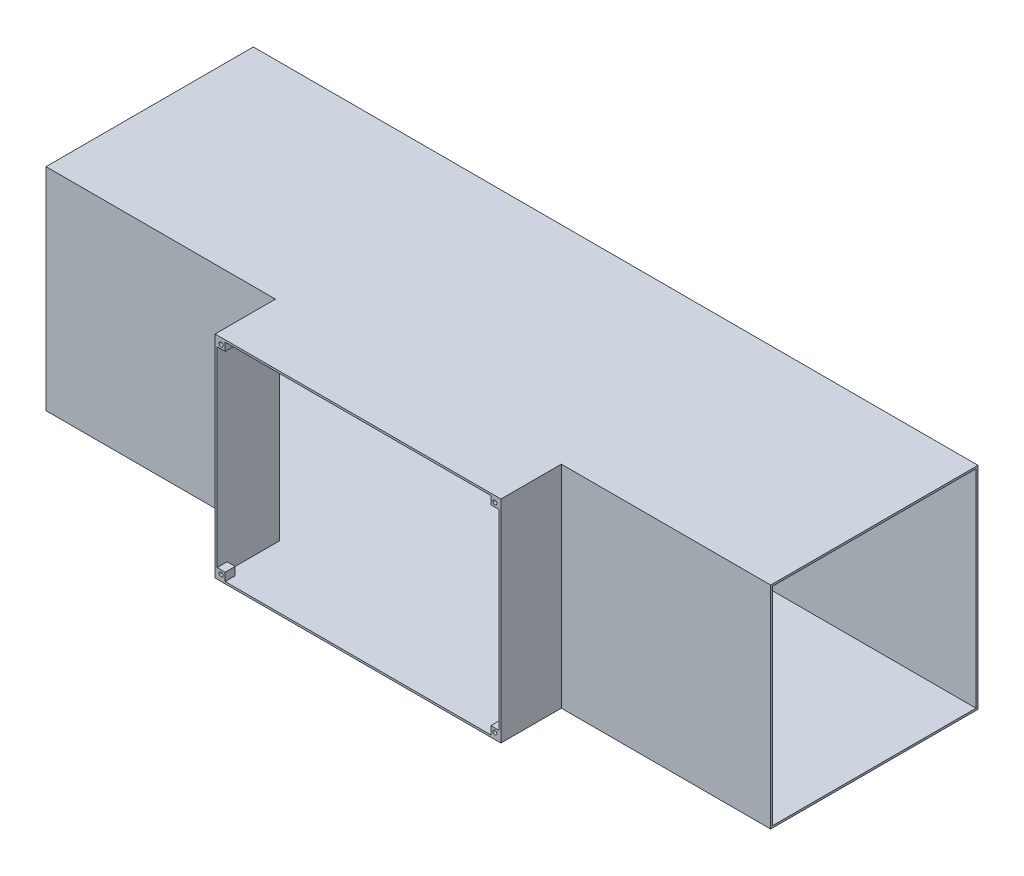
ISO-10303-21;
HEADER;
FILE_DESCRIPTION(('STEP AP214'),'2;1');
FILE_NAME('part.step','',(''),(''),'','','');
FILE_SCHEMA(('AUTOMOTIVE_DESIGN { 1 0 10303 214 1 1 1 1 }'));
ENDSEC;
DATA;
#1=APPLICATION_CONTEXT('core data for automotive mechanical design processes');
#2=APPLICATION_PROTOCOL_DEFINITION('international standard','automotive_design',2000,#1);
#3=PRODUCT_CONTEXT('',#1,'mechanical');
#4=PRODUCT('Part','Part','',(#3));
#5=PRODUCT_RELATED_PRODUCT_CATEGORY('part','',(#4));
#6=PRODUCT_DEFINITION_FORMATION('','',#4);
#7=PRODUCT_DEFINITION_CONTEXT('part definition',#1,'design');
#8=PRODUCT_DEFINITION('design','',#6,#7);
#9=PRODUCT_DEFINITION_SHAPE('','',#8);
#10=(LENGTH_UNIT() NAMED_UNIT(*) SI_UNIT(.MILLI.,.METRE.));
#11=(NAMED_UNIT(*) PLANE_ANGLE_UNIT() SI_UNIT($,.RADIAN.));
#12=(NAMED_UNIT(*) SI_UNIT($,.STERADIAN.) SOLID_ANGLE_UNIT());
#13=UNCERTAINTY_MEASURE_WITH_UNIT(LENGTH_MEASURE(1.E-05),#10,'distance_accuracy_value','');
#14=(GEOMETRIC_REPRESENTATION_CONTEXT(3) GLOBAL_UNCERTAINTY_ASSIGNED_CONTEXT((#13)) GLOBAL_UNIT_ASSIGNED_CONTEXT((#10,
#11,#12)) REPRESENTATION_CONTEXT('',''));
#15=CARTESIAN_POINT('',(0.,0.,0.));
#16=DIRECTION('',(0.,0.,1.));
#17=DIRECTION('',(1.,0.,0.));
#18=AXIS2_PLACEMENT_3D('',#15,#16,#17);
#19=CARTESIAN_POINT('',(914.4,-93.1483451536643,118.815555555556));
#20=DIRECTION('',(0.,0.,-1.));
#21=DIRECTION('',(0.,1.,0.));
#22=AXIS2_PLACEMENT_3D('',#19,#20,#21);
#23=PLANE('',#22);
#24=DIRECTION('',(0.,-1.,0.));
#25=VECTOR('',#24,1.);
#26=CARTESIAN_POINT('',(289.56,-93.1483451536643,118.815555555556));
#27=LINE('',#26,#25);
#28=CARTESIAN_POINT('',(289.56,173.551654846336,118.815555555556));
#29=VERTEX_POINT('',#28);
#30=CARTESIAN_POINT('',(289.56,-93.1483451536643,118.815555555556));
#31=VERTEX_POINT('',#30);
#32=EDGE_CURVE('E350',#29,#31,#27,.T.);
#33=ORIENTED_EDGE('',*,*,#32,.F.);
#34=DIRECTION('',(-1.,0.,0.));
#35=VECTOR('',#34,1.);
#36=CARTESIAN_POINT('',(914.4,173.551654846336,118.815555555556));
#37=LINE('',#36,#35);
#38=CARTESIAN_POINT('',(0.,173.551654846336,118.815555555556));
#39=VERTEX_POINT('',#38);
#40=EDGE_CURVE('E447',#29,#39,#37,.T.);
#41=ORIENTED_EDGE('',*,*,#40,.T.);
#42=DIRECTION('',(0.,-1.,0.));
#43=VECTOR('',#42,1.);
#44=CARTESIAN_POINT('',(0.,-93.1483451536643,118.815555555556));
#45=LINE('',#44,#43);
#46=CARTESIAN_POINT('',(0.,-93.1483451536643,118.815555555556));
#47=VERTEX_POINT('',#46);
#48=EDGE_CURVE('E428',#39,#47,#45,.T.);
#49=ORIENTED_EDGE('',*,*,#48,.T.);
#50=DIRECTION('',(-1.,0.,0.));
#51=VECTOR('',#50,1.);
#52=CARTESIAN_POINT('',(914.4,-93.1483451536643,118.815555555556));
#53=LINE('',#52,#51);
#54=EDGE_CURVE('E434',#31,#47,#53,.T.);
#55=ORIENTED_EDGE('',*,*,#54,.F.);
#56=EDGE_LOOP('',(#33,#41,#49,#55));
#57=FACE_BOUND('',#56,.T.);
#58=ADVANCED_FACE('F32',(#57),#23,.F.);
#59=DIRECTION('',(0.,1.,0.));
#60=VECTOR('',#59,1.);
#61=CARTESIAN_POINT('',(650.24,-93.1483451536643,118.815555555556));
#62=LINE('',#61,#60);
#63=CARTESIAN_POINT('',(650.24,-93.1483451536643,118.815555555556));
#64=VERTEX_POINT('',#63);
#65=CARTESIAN_POINT('',(650.24,173.551654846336,118.815555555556));
#66=VERTEX_POINT('',#65);
#67=EDGE_CURVE('E345',#64,#66,#62,.T.);
#68=ORIENTED_EDGE('',*,*,#67,.F.);
#69=CARTESIAN_POINT('',(914.4,-93.1483451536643,118.815555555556));
#70=VERTEX_POINT('',#69);
#71=EDGE_CURVE('E444',#70,#64,#53,.T.);
#72=ORIENTED_EDGE('',*,*,#71,.F.);
#73=DIRECTION('',(0.,-1.,0.));
#74=VECTOR('',#73,1.);
#75=CARTESIAN_POINT('',(914.4,-93.1483451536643,118.815555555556));
#76=LINE('',#75,#74);
#77=CARTESIAN_POINT('',(914.4,173.551654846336,118.815555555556));
#78=VERTEX_POINT('',#77);
#79=EDGE_CURVE('E432',#78,#70,#76,.T.);
#80=ORIENTED_EDGE('',*,*,#79,.F.);
#81=EDGE_CURVE('E448',#78,#66,#37,.T.);
#82=ORIENTED_EDGE('',*,*,#81,.T.);
#83=EDGE_LOOP('',(#68,#72,#80,#82));
#84=FACE_BOUND('',#83,.T.);
#85=ADVANCED_FACE('F481',(#84),#23,.F.);
#86=CARTESIAN_POINT('',(914.4,-90.6083451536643,116.275555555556));
#87=DIRECTION('',(0.,0.,-1.));
#88=DIRECTION('',(-1.,0.,0.));
#89=AXIS2_PLACEMENT_3D('',#86,#87,#88);
#90=PLANE('',#89);
#91=DIRECTION('',(0.,1.,0.));
#92=VECTOR('',#91,1.);
#93=CARTESIAN_POINT('',(292.1,-90.6083451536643,116.275555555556));
#94=LINE('',#93,#92);
#95=CARTESIAN_POINT('',(292.1,-90.6083451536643,116.275555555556));
#96=VERTEX_POINT('',#95);
#97=CARTESIAN_POINT('',(292.1,171.011654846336,116.275555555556));
#98=VERTEX_POINT('',#97);
#99=EDGE_CURVE('E386',#96,#98,#94,.T.);
#100=ORIENTED_EDGE('',*,*,#99,.F.);
#101=DIRECTION('',(-1.,0.,0.));
#102=VECTOR('',#101,1.);
#103=CARTESIAN_POINT('',(914.4,-90.6083451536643,116.275555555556));
#104=LINE('',#103,#102);
#105=CARTESIAN_POINT('',(0.,-90.6083451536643,116.275555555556));
#106=VERTEX_POINT('',#105);
#107=EDGE_CURVE('E412',#96,#106,#104,.T.);
#108=ORIENTED_EDGE('',*,*,#107,.T.);
#109=DIRECTION('',(0.,-1.,0.));
#110=VECTOR('',#109,1.);
#111=CARTESIAN_POINT('',(0.,-90.6083451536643,116.275555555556));
#112=LINE('',#111,#110);
#113=CARTESIAN_POINT('',(0.,171.011654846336,116.275555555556));
#114=VERTEX_POINT('',#113);
#115=EDGE_CURVE('E405',#114,#106,#112,.T.);
#116=ORIENTED_EDGE('',*,*,#115,.F.);
#117=DIRECTION('',(-1.,0.,0.));
#118=VECTOR('',#117,1.);
#119=CARTESIAN_POINT('',(914.4,171.011654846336,116.275555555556));
#120=LINE('',#119,#118);
#121=EDGE_CURVE('E416',#98,#114,#120,.T.);
#122=ORIENTED_EDGE('',*,*,#121,.F.);
#123=EDGE_LOOP('',(#100,#108,#116,#122));
#124=FACE_BOUND('',#123,.T.);
#125=ADVANCED_FACE('F501',(#124),#90,.T.);
#126=CARTESIAN_POINT('',(914.4,0.,0.));
#127=DIRECTION('',(-1.,0.,0.));
#128=DIRECTION('',(0.,0.,1.));
#129=AXIS2_PLACEMENT_3D('',#126,#127,#128);
#130=PLANE('',#129);
#131=DIRECTION('',(0.,0.,-1.));
#132=VECTOR('',#131,1.);
#133=CARTESIAN_POINT('',(914.4,-93.1483451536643,-142.804444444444));
#134=LINE('',#133,#132);
#135=CARTESIAN_POINT('',(914.4,-93.1483451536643,-142.804444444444));
#136=VERTEX_POINT('',#135);
#137=EDGE_CURVE('E424',#70,#136,#134,.T.);
#138=ORIENTED_EDGE('',*,*,#137,.T.);
#139=DIRECTION('',(0.,1.,0.));
#140=VECTOR('',#139,1.);
#141=CARTESIAN_POINT('',(914.4,-93.1483451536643,-142.804444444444));
#142=LINE('',#141,#140);
#143=CARTESIAN_POINT('',(914.4,173.551654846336,-142.804444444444));
#144=VERTEX_POINT('',#143);
#145=EDGE_CURVE('E427',#136,#144,#142,.T.);
#146=ORIENTED_EDGE('',*,*,#145,.T.);
#147=DIRECTION('',(0.,0.,1.));
#148=VECTOR('',#147,1.);
#149=CARTESIAN_POINT('',(914.4,173.551654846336,-142.804444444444));
#150=LINE('',#149,#148);
#151=EDGE_CURVE('E430',#144,#78,#150,.T.);
#152=ORIENTED_EDGE('',*,*,#151,.T.);
#153=ORIENTED_EDGE('',*,*,#79,.T.);
#154=EDGE_LOOP('',(#138,#146,#152,#153));
#155=FACE_BOUND('',#154,.T.);
#156=DIRECTION('',(0.,1.,0.));
#157=VECTOR('',#156,1.);
#158=CARTESIAN_POINT('',(914.4,-90.6083451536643,-140.264444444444));
#159=LINE('',#158,#157);
#160=CARTESIAN_POINT('',(914.4,-90.6083451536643,-140.264444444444));
#161=VERTEX_POINT('',#160);
#162=CARTESIAN_POINT('',(914.4,171.011654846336,-140.264444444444));
#163=VERTEX_POINT('',#162);
#164=EDGE_CURVE('E389',#161,#163,#159,.T.);
#165=ORIENTED_EDGE('',*,*,#164,.F.);
#166=DIRECTION('',(0.,0.,-1.));
#167=VECTOR('',#166,1.);
#168=CARTESIAN_POINT('',(914.4,-90.6083451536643,-140.264444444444));
#169=LINE('',#168,#167);
#170=CARTESIAN_POINT('',(914.4,-90.6083451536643,116.275555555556));
#171=VERTEX_POINT('',#170);
#172=EDGE_CURVE('E397',#171,#161,#169,.T.);
#173=ORIENTED_EDGE('',*,*,#172,.F.);
#174=DIRECTION('',(0.,-1.,0.));
#175=VECTOR('',#174,1.);
#176=CARTESIAN_POINT('',(914.4,-90.6083451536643,116.275555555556));
#177=LINE('',#176,#175);
#178=CARTESIAN_POINT('',(914.4,171.011654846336,116.275555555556));
#179=VERTEX_POINT('',#178);
#180=EDGE_CURVE('E394',#179,#171,#177,.T.);
#181=ORIENTED_EDGE('',*,*,#180,.F.);
#182=DIRECTION('',(0.,0.,1.));
#183=VECTOR('',#182,1.);
#184=CARTESIAN_POINT('',(914.4,171.011654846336,-140.264444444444));
#185=LINE('',#184,#183);
#186=EDGE_CURVE('E391',#163,#179,#185,.T.);
#187=ORIENTED_EDGE('',*,*,#186,.F.);
#188=EDGE_LOOP('',(#165,#173,#181,#187));
#189=FACE_BOUND('',#188,.T.);
#190=ADVANCED_FACE('F486',(#155,#189),#130,.F.);
#191=CARTESIAN_POINT('',(0.,0.,0.));
#192=DIRECTION('',(-1.,0.,0.));
#193=DIRECTION('',(0.,0.,1.));
#194=AXIS2_PLACEMENT_3D('',#191,#192,#193);
#195=PLANE('',#194);
#196=DIRECTION('',(0.,0.,-1.));
#197=VECTOR('',#196,1.);
#198=CARTESIAN_POINT('',(0.,-93.1483451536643,-142.804444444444));
#199=LINE('',#198,#197);
#200=CARTESIAN_POINT('',(0.,-93.1483451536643,-142.804444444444));
#201=VERTEX_POINT('',#200);
#202=EDGE_CURVE('E423',#47,#201,#199,.T.);
#203=ORIENTED_EDGE('',*,*,#202,.F.);
#204=ORIENTED_EDGE('',*,*,#48,.F.);
#205=DIRECTION('',(0.,0.,1.));
#206=VECTOR('',#205,1.);
#207=CARTESIAN_POINT('',(0.,173.551654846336,-142.804444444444));
#208=LINE('',#207,#206);
#209=CARTESIAN_POINT('',(0.,173.551654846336,-142.804444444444));
#210=VERTEX_POINT('',#209);
#211=EDGE_CURVE('E439',#210,#39,#208,.T.);
#212=ORIENTED_EDGE('',*,*,#211,.F.);
#213=DIRECTION('',(0.,1.,0.));
#214=VECTOR('',#213,1.);
#215=CARTESIAN_POINT('',(0.,-93.1483451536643,-142.804444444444));
#216=LINE('',#215,#214);
#217=EDGE_CURVE('E437',#201,#210,#216,.T.);
#218=ORIENTED_EDGE('',*,*,#217,.F.);
#219=EDGE_LOOP('',(#203,#204,#212,#218));
#220=FACE_BOUND('',#219,.T.);
#221=DIRECTION('',(0.,0.,-1.));
#222=VECTOR('',#221,1.);
#223=CARTESIAN_POINT('',(0.,-90.6083451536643,-140.264444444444));
#224=LINE('',#223,#222);
#225=CARTESIAN_POINT('',(0.,-90.6083451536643,-140.264444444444));
#226=VERTEX_POINT('',#225);
#227=EDGE_CURVE('E392',#106,#226,#224,.T.);
#228=ORIENTED_EDGE('',*,*,#227,.T.);
#229=DIRECTION('',(0.,1.,0.));
#230=VECTOR('',#229,1.);
#231=CARTESIAN_POINT('',(0.,-90.6083451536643,-140.264444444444));
#232=LINE('',#231,#230);
#233=CARTESIAN_POINT('',(0.,171.011654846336,-140.264444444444));
#234=VERTEX_POINT('',#233);
#235=EDGE_CURVE('E388',#226,#234,#232,.T.);
#236=ORIENTED_EDGE('',*,*,#235,.T.);
#237=DIRECTION('',(0.,0.,1.));
#238=VECTOR('',#237,1.);
#239=CARTESIAN_POINT('',(0.,171.011654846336,-140.264444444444));
#240=LINE('',#239,#238);
#241=EDGE_CURVE('E402',#234,#114,#240,.T.);
#242=ORIENTED_EDGE('',*,*,#241,.T.);
#243=ORIENTED_EDGE('',*,*,#115,.T.);
#244=EDGE_LOOP('',(#228,#236,#242,#243));
#245=FACE_BOUND('',#244,.T.);
#246=ADVANCED_FACE('F461',(#220,#245),#195,.T.);
#247=CARTESIAN_POINT('',(914.4,-93.1483451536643,-142.804444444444));
#248=DIRECTION('',(0.,1.,0.));
#249=DIRECTION('',(0.,0.,1.));
#250=AXIS2_PLACEMENT_3D('',#247,#248,#249);
#251=PLANE('',#250);
#252=ORIENTED_EDGE('',*,*,#202,.T.);
#253=DIRECTION('',(-1.,0.,0.));
#254=VECTOR('',#253,1.);
#255=CARTESIAN_POINT('',(914.4,-93.1483451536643,-142.804444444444));
#256=LINE('',#255,#254);
#257=EDGE_CURVE('E11',#136,#201,#256,.T.);
#258=ORIENTED_EDGE('',*,*,#257,.F.);
#259=ORIENTED_EDGE('',*,*,#137,.F.);
#260=ORIENTED_EDGE('',*,*,#71,.T.);
#261=DIRECTION('',(0.,0.,-1.));
#262=VECTOR('',#261,1.);
#263=CARTESIAN_POINT('',(650.24,-93.1483451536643,195.015555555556));
#264=LINE('',#263,#262);
#265=CARTESIAN_POINT('',(650.24,-93.1483451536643,195.015555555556));
#266=VERTEX_POINT('',#265);
#267=EDGE_CURVE('E369',#266,#64,#264,.T.);
#268=ORIENTED_EDGE('',*,*,#267,.F.);
#269=DIRECTION('',(1.,0.,0.));
#270=VECTOR('',#269,1.);
#271=CARTESIAN_POINT('',(289.56,-93.1483451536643,195.015555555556));
#272=LINE('',#271,#270);
#273=CARTESIAN_POINT('',(289.56,-93.1483451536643,195.015555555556));
#274=VERTEX_POINT('',#273);
#275=EDGE_CURVE('E346',#274,#266,#272,.T.);
#276=ORIENTED_EDGE('',*,*,#275,.F.);
#277=DIRECTION('',(0.,0.,-1.));
#278=VECTOR('',#277,1.);
#279=CARTESIAN_POINT('',(289.56,-93.1483451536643,195.015555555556));
#280=LINE('',#279,#278);
#281=EDGE_CURVE('E356',#274,#31,#280,.T.);
#282=ORIENTED_EDGE('',*,*,#281,.T.);
#283=ORIENTED_EDGE('',*,*,#54,.T.);
#284=EDGE_LOOP('',(#252,#258,#259,#260,#268,#276,#282,#283));
#285=FACE_BOUND('',#284,.T.);
#286=ADVANCED_FACE('F34',(#285),#251,.F.);
#287=CARTESIAN_POINT('',(914.4,-93.1483451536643,-142.804444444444));
#288=DIRECTION('',(0.,0.,1.));
#289=DIRECTION('',(1.,0.,0.));
#290=AXIS2_PLACEMENT_3D('',#287,#288,#289);
#291=PLANE('',#290);
#292=ORIENTED_EDGE('',*,*,#217,.T.);
#293=DIRECTION('',(-1.,0.,0.));
#294=VECTOR('',#293,1.);
#295=CARTESIAN_POINT('',(914.4,173.551654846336,-142.804444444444));
#296=LINE('',#295,#294);
#297=EDGE_CURVE('E40',#144,#210,#296,.T.);
#298=ORIENTED_EDGE('',*,*,#297,.F.);
#299=ORIENTED_EDGE('',*,*,#145,.F.);
#300=ORIENTED_EDGE('',*,*,#257,.T.);
#301=EDGE_LOOP('',(#292,#298,#299,#300));
#302=FACE_BOUND('',#301,.T.);
#303=ADVANCED_FACE('F488',(#302),#291,.F.);
#304=CARTESIAN_POINT('',(914.4,173.551654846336,-142.804444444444));
#305=DIRECTION('',(0.,-1.,0.));
#306=DIRECTION('',(0.,0.,-1.));
#307=AXIS2_PLACEMENT_3D('',#304,#305,#306);
#308=PLANE('',#307);
#309=ORIENTED_EDGE('',*,*,#211,.T.);
#310=ORIENTED_EDGE('',*,*,#40,.F.);
#311=DIRECTION('',(0.,0.,-1.));
#312=VECTOR('',#311,1.);
#313=CARTESIAN_POINT('',(289.56,173.551654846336,195.015555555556));
#314=LINE('',#313,#312);
#315=CARTESIAN_POINT('',(289.56,173.551654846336,195.015555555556));
#316=VERTEX_POINT('',#315);
#317=EDGE_CURVE('E363',#316,#29,#314,.T.);
#318=ORIENTED_EDGE('',*,*,#317,.F.);
#319=DIRECTION('',(-1.,0.,0.));
#320=VECTOR('',#319,1.);
#321=CARTESIAN_POINT('',(289.56,173.551654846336,195.015555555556));
#322=LINE('',#321,#320);
#323=CARTESIAN_POINT('',(650.24,173.551654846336,195.015555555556));
#324=VERTEX_POINT('',#323);
#325=EDGE_CURVE('E352',#324,#316,#322,.T.);
#326=ORIENTED_EDGE('',*,*,#325,.F.);
#327=DIRECTION('',(0.,0.,-1.));
#328=VECTOR('',#327,1.);
#329=CARTESIAN_POINT('',(650.24,173.551654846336,195.015555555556));
#330=LINE('',#329,#328);
#331=EDGE_CURVE('E366',#324,#66,#330,.T.);
#332=ORIENTED_EDGE('',*,*,#331,.T.);
#333=ORIENTED_EDGE('',*,*,#81,.F.);
#334=ORIENTED_EDGE('',*,*,#151,.F.);
#335=ORIENTED_EDGE('',*,*,#297,.T.);
#336=EDGE_LOOP('',(#309,#310,#318,#326,#332,#333,#334,#335));
#337=FACE_BOUND('',#336,.T.);
#338=ADVANCED_FACE('F454',(#337),#308,.F.);
#339=CARTESIAN_POINT('',(914.4,-90.6083451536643,-140.264444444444));
#340=DIRECTION('',(0.,0.,1.));
#341=DIRECTION('',(1.,0.,0.));
#342=AXIS2_PLACEMENT_3D('',#339,#340,#341);
#343=PLANE('',#342);
#344=ORIENTED_EDGE('',*,*,#235,.F.);
#345=DIRECTION('',(-1.,0.,0.));
#346=VECTOR('',#345,1.);
#347=CARTESIAN_POINT('',(914.4,-90.6083451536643,-140.264444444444));
#348=LINE('',#347,#346);
#349=EDGE_CURVE('E399',#161,#226,#348,.T.);
#350=ORIENTED_EDGE('',*,*,#349,.F.);
#351=ORIENTED_EDGE('',*,*,#164,.T.);
#352=DIRECTION('',(-1.,0.,0.));
#353=VECTOR('',#352,1.);
#354=CARTESIAN_POINT('',(914.4,171.011654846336,-140.264444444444));
#355=LINE('',#354,#353);
#356=EDGE_CURVE('E420',#163,#234,#355,.T.);
#357=ORIENTED_EDGE('',*,*,#356,.T.);
#358=EDGE_LOOP('',(#344,#350,#351,#357));
#359=FACE_BOUND('',#358,.T.);
#360=ADVANCED_FACE('F494',(#359),#343,.T.);
#361=CARTESIAN_POINT('',(914.4,171.011654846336,-140.264444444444));
#362=DIRECTION('',(0.,-1.,0.));
#363=DIRECTION('',(0.,0.,-1.));
#364=AXIS2_PLACEMENT_3D('',#361,#362,#363);
#365=PLANE('',#364);
#366=DIRECTION('',(0.,0.,1.));
#367=VECTOR('',#366,1.);
#368=CARTESIAN_POINT('',(637.54,171.011654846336,182.315555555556));
#369=LINE('',#368,#367);
#370=CARTESIAN_POINT('',(637.54,171.011654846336,182.315555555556));
#371=VERTEX_POINT('',#370);
#372=CARTESIAN_POINT('',(637.54,171.011654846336,195.015555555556));
#373=VERTEX_POINT('',#372);
#374=EDGE_CURVE('E302',#371,#373,#369,.T.);
#375=ORIENTED_EDGE('',*,*,#374,.T.);
#376=DIRECTION('',(-1.,0.,0.));
#377=VECTOR('',#376,1.);
#378=CARTESIAN_POINT('',(292.1,171.011654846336,195.015555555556));
#379=LINE('',#378,#377);
#380=CARTESIAN_POINT('',(302.26,171.011654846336,195.015555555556));
#381=VERTEX_POINT('',#380);
#382=EDGE_CURVE('E343',#373,#381,#379,.T.);
#383=ORIENTED_EDGE('',*,*,#382,.T.);
#384=DIRECTION('',(0.,0.,1.));
#385=VECTOR('',#384,1.);
#386=CARTESIAN_POINT('',(302.26,171.011654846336,182.315555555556));
#387=LINE('',#386,#385);
#388=CARTESIAN_POINT('',(302.26,171.011654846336,182.315555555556));
#389=VERTEX_POINT('',#388);
#390=EDGE_CURVE('E331',#389,#381,#387,.T.);
#391=ORIENTED_EDGE('',*,*,#390,.F.);
#392=DIRECTION('',(-1.,0.,0.));
#393=VECTOR('',#392,1.);
#394=CARTESIAN_POINT('',(292.1,171.011654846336,182.315555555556));
#395=LINE('',#394,#393);
#396=CARTESIAN_POINT('',(292.1,171.011654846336,182.315555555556));
#397=VERTEX_POINT('',#396);
#398=EDGE_CURVE('E324',#389,#397,#395,.T.);
#399=ORIENTED_EDGE('',*,*,#398,.T.);
#400=DIRECTION('',(0.,0.,1.));
#401=VECTOR('',#400,1.);
#402=CARTESIAN_POINT('',(292.1,171.011654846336,93.4155555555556));
#403=LINE('',#402,#401);
#404=EDGE_CURVE('E373',#98,#397,#403,.T.);
#405=ORIENTED_EDGE('',*,*,#404,.F.);
#406=ORIENTED_EDGE('',*,*,#121,.T.);
#407=ORIENTED_EDGE('',*,*,#241,.F.);
#408=ORIENTED_EDGE('',*,*,#356,.F.);
#409=ORIENTED_EDGE('',*,*,#186,.T.);
#410=CARTESIAN_POINT('',(647.7,171.011654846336,116.275555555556));
#411=VERTEX_POINT('',#410);
#412=EDGE_CURVE('E417',#179,#411,#120,.T.);
#413=ORIENTED_EDGE('',*,*,#412,.T.);
#414=DIRECTION('',(0.,0.,1.));
#415=VECTOR('',#414,1.);
#416=CARTESIAN_POINT('',(647.7,171.011654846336,93.4155555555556));
#417=LINE('',#416,#415);
#418=CARTESIAN_POINT('',(647.7,171.011654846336,182.315555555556));
#419=VERTEX_POINT('',#418);
#420=EDGE_CURVE('E377',#411,#419,#417,.T.);
#421=ORIENTED_EDGE('',*,*,#420,.T.);
#422=DIRECTION('',(-1.,0.,0.));
#423=VECTOR('',#422,1.);
#424=CARTESIAN_POINT('',(637.54,171.011654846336,182.315555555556));
#425=LINE('',#424,#423);
#426=EDGE_CURVE('E295',#419,#371,#425,.T.);
#427=ORIENTED_EDGE('',*,*,#426,.T.);
#428=EDGE_LOOP('',(#375,#383,#391,#399,#405,#406,#407,#408,#409,#413,#421,#427));
#429=FACE_BOUND('',#428,.T.);
#430=ADVANCED_FACE('F509',(#429),#365,.T.);
#431=DIRECTION('',(0.,-1.,0.));
#432=VECTOR('',#431,1.);
#433=CARTESIAN_POINT('',(647.7,-90.6083451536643,116.275555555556));
#434=LINE('',#433,#432);
#435=CARTESIAN_POINT('',(647.7,-90.6083451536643,116.275555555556));
#436=VERTEX_POINT('',#435);
#437=EDGE_CURVE('E376',#411,#436,#434,.T.);
#438=ORIENTED_EDGE('',*,*,#437,.F.);
#439=ORIENTED_EDGE('',*,*,#412,.F.);
#440=ORIENTED_EDGE('',*,*,#180,.T.);
#441=EDGE_CURVE('E413',#171,#436,#104,.T.);
#442=ORIENTED_EDGE('',*,*,#441,.T.);
#443=EDGE_LOOP('',(#438,#439,#440,#442));
#444=FACE_BOUND('',#443,.T.);
#445=ADVANCED_FACE('F513',(#444),#90,.T.);
#446=CARTESIAN_POINT('',(914.4,-90.6083451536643,-140.264444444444));
#447=DIRECTION('',(0.,1.,0.));
#448=DIRECTION('',(0.,0.,1.));
#449=AXIS2_PLACEMENT_3D('',#446,#447,#448);
#450=PLANE('',#449);
#451=DIRECTION('',(0.,0.,1.));
#452=VECTOR('',#451,1.);
#453=CARTESIAN_POINT('',(637.54,-90.6083451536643,182.315555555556));
#454=LINE('',#453,#452);
#455=CARTESIAN_POINT('',(637.54,-90.6083451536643,182.315555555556));
#456=VERTEX_POINT('',#455);
#457=CARTESIAN_POINT('',(637.54,-90.6083451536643,195.015555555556));
#458=VERTEX_POINT('',#457);
#459=EDGE_CURVE('E47',#456,#458,#454,.T.);
#460=ORIENTED_EDGE('',*,*,#459,.F.);
#461=DIRECTION('',(1.,0.,0.));
#462=VECTOR('',#461,1.);
#463=CARTESIAN_POINT('',(637.54,-90.6083451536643,182.315555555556));
#464=LINE('',#463,#462);
#465=CARTESIAN_POINT('',(647.7,-90.6083451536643,182.315555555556));
#466=VERTEX_POINT('',#465);
#467=EDGE_CURVE('E233',#456,#466,#464,.T.);
#468=ORIENTED_EDGE('',*,*,#467,.T.);
#469=DIRECTION('',(0.,0.,1.));
#470=VECTOR('',#469,1.);
#471=CARTESIAN_POINT('',(647.7,-90.6083451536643,93.4155555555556));
#472=LINE('',#471,#470);
#473=EDGE_CURVE('E380',#436,#466,#472,.T.);
#474=ORIENTED_EDGE('',*,*,#473,.F.);
#475=ORIENTED_EDGE('',*,*,#441,.F.);
#476=ORIENTED_EDGE('',*,*,#172,.T.);
#477=ORIENTED_EDGE('',*,*,#349,.T.);
#478=ORIENTED_EDGE('',*,*,#227,.F.);
#479=ORIENTED_EDGE('',*,*,#107,.F.);
#480=DIRECTION('',(0.,0.,1.));
#481=VECTOR('',#480,1.);
#482=CARTESIAN_POINT('',(292.1,-90.6083451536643,93.4155555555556));
#483=LINE('',#482,#481);
#484=CARTESIAN_POINT('',(292.1,-90.6083451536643,182.315555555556));
#485=VERTEX_POINT('',#484);
#486=EDGE_CURVE('E372',#96,#485,#483,.T.);
#487=ORIENTED_EDGE('',*,*,#486,.T.);
#488=DIRECTION('',(1.,0.,0.));
#489=VECTOR('',#488,1.);
#490=CARTESIAN_POINT('',(292.1,-90.6083451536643,182.315555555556));
#491=LINE('',#490,#489);
#492=CARTESIAN_POINT('',(302.26,-90.6083451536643,182.315555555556));
#493=VERTEX_POINT('',#492);
#494=EDGE_CURVE('E263',#485,#493,#491,.T.);
#495=ORIENTED_EDGE('',*,*,#494,.T.);
#496=DIRECTION('',(0.,0.,1.));
#497=VECTOR('',#496,1.);
#498=CARTESIAN_POINT('',(302.26,-90.6083451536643,182.315555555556));
#499=LINE('',#498,#497);
#500=CARTESIAN_POINT('',(302.26,-90.6083451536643,195.015555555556));
#501=VERTEX_POINT('',#500);
#502=EDGE_CURVE('E276',#493,#501,#499,.T.);
#503=ORIENTED_EDGE('',*,*,#502,.T.);
#504=DIRECTION('',(1.,0.,0.));
#505=VECTOR('',#504,1.);
#506=CARTESIAN_POINT('',(292.1,-90.6083451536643,195.015555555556));
#507=LINE('',#506,#505);
#508=EDGE_CURVE('E339',#501,#458,#507,.T.);
#509=ORIENTED_EDGE('',*,*,#508,.T.);
#510=EDGE_LOOP('',(#460,#468,#474,#475,#476,#477,#478,#479,#487,#495,#503,#509));
#511=FACE_BOUND('',#510,.T.);
#512=ADVANCED_FACE('F517',(#511),#450,.T.);
#513=CARTESIAN_POINT('',(292.1,171.011654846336,93.4155555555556));
#514=DIRECTION('',(-1.,0.,0.));
#515=DIRECTION('',(0.,0.,1.));
#516=AXIS2_PLACEMENT_3D('',#513,#514,#515);
#517=PLANE('',#516);
#518=DIRECTION('',(0.,-1.,0.));
#519=VECTOR('',#518,1.);
#520=CARTESIAN_POINT('',(292.1,-90.6083451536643,195.015555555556));
#521=LINE('',#520,#519);
#522=CARTESIAN_POINT('',(292.1,160.851654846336,195.015555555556));
#523=VERTEX_POINT('',#522);
#524=CARTESIAN_POINT('',(292.1,-80.4483451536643,195.015555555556));
#525=VERTEX_POINT('',#524);
#526=EDGE_CURVE('E334',#523,#525,#521,.T.);
#527=ORIENTED_EDGE('',*,*,#526,.T.);
#528=DIRECTION('',(0.,0.,1.));
#529=VECTOR('',#528,1.);
#530=CARTESIAN_POINT('',(292.1,-80.4483451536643,182.315555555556));
#531=LINE('',#530,#529);
#532=CARTESIAN_POINT('',(292.1,-80.4483451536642,182.315555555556));
#533=VERTEX_POINT('',#532);
#534=EDGE_CURVE('E268',#533,#525,#531,.T.);
#535=ORIENTED_EDGE('',*,*,#534,.F.);
#536=DIRECTION('',(0.,-1.,0.));
#537=VECTOR('',#536,1.);
#538=CARTESIAN_POINT('',(292.1,-80.4483451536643,182.315555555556));
#539=LINE('',#538,#537);
#540=EDGE_CURVE('E260',#533,#485,#539,.T.);
#541=ORIENTED_EDGE('',*,*,#540,.T.);
#542=ORIENTED_EDGE('',*,*,#486,.F.);
#543=ORIENTED_EDGE('',*,*,#99,.T.);
#544=ORIENTED_EDGE('',*,*,#404,.T.);
#545=DIRECTION('',(0.,-1.,0.));
#546=VECTOR('',#545,1.);
#547=CARTESIAN_POINT('',(292.1,171.011654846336,182.315555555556));
#548=LINE('',#547,#546);
#549=CARTESIAN_POINT('',(292.1,160.851654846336,182.315555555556));
#550=VERTEX_POINT('',#549);
#551=EDGE_CURVE('E315',#397,#550,#548,.T.);
#552=ORIENTED_EDGE('',*,*,#551,.T.);
#553=DIRECTION('',(0.,0.,1.));
#554=VECTOR('',#553,1.);
#555=CARTESIAN_POINT('',(292.1,160.851654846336,182.315555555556));
#556=LINE('',#555,#554);
#557=EDGE_CURVE('E326',#550,#523,#556,.T.);
#558=ORIENTED_EDGE('',*,*,#557,.T.);
#559=EDGE_LOOP('',(#527,#535,#541,#542,#543,#544,#552,#558));
#560=FACE_BOUND('',#559,.T.);
#561=ADVANCED_FACE('F521',(#560),#517,.F.);
#562=CARTESIAN_POINT('',(647.7,171.011654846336,93.4155555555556));
#563=DIRECTION('',(1.,0.,0.));
#564=DIRECTION('',(0.,0.,-1.));
#565=AXIS2_PLACEMENT_3D('',#562,#563,#564);
#566=PLANE('',#565);
#567=DIRECTION('',(0.,1.,0.));
#568=VECTOR('',#567,1.);
#569=CARTESIAN_POINT('',(647.7,-80.4483451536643,182.315555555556));
#570=LINE('',#569,#568);
#571=CARTESIAN_POINT('',(647.7,-80.4483451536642,182.315555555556));
#572=VERTEX_POINT('',#571);
#573=EDGE_CURVE('E55',#466,#572,#570,.T.);
#574=ORIENTED_EDGE('',*,*,#573,.T.);
#575=DIRECTION('',(0.,0.,1.));
#576=VECTOR('',#575,1.);
#577=CARTESIAN_POINT('',(647.7,-80.4483451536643,182.315555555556));
#578=LINE('',#577,#576);
#579=CARTESIAN_POINT('',(647.7,-80.4483451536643,195.015555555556));
#580=VERTEX_POINT('',#579);
#581=EDGE_CURVE('E236',#572,#580,#578,.T.);
#582=ORIENTED_EDGE('',*,*,#581,.T.);
#583=DIRECTION('',(0.,1.,0.));
#584=VECTOR('',#583,1.);
#585=CARTESIAN_POINT('',(647.7,-90.6083451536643,195.015555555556));
#586=LINE('',#585,#584);
#587=CARTESIAN_POINT('',(647.7,160.851654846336,195.015555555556));
#588=VERTEX_POINT('',#587);
#589=EDGE_CURVE('E341',#580,#588,#586,.T.);
#590=ORIENTED_EDGE('',*,*,#589,.T.);
#591=DIRECTION('',(0.,0.,1.));
#592=VECTOR('',#591,1.);
#593=CARTESIAN_POINT('',(647.7,160.851654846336,182.315555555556));
#594=LINE('',#593,#592);
#595=CARTESIAN_POINT('',(647.7,160.851654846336,182.315555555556));
#596=VERTEX_POINT('',#595);
#597=EDGE_CURVE('E305',#596,#588,#594,.T.);
#598=ORIENTED_EDGE('',*,*,#597,.F.);
#599=DIRECTION('',(0.,1.,0.));
#600=VECTOR('',#599,1.);
#601=CARTESIAN_POINT('',(647.7,171.011654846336,182.315555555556));
#602=LINE('',#601,#600);
#603=EDGE_CURVE('E293',#596,#419,#602,.T.);
#604=ORIENTED_EDGE('',*,*,#603,.T.);
#605=ORIENTED_EDGE('',*,*,#420,.F.);
#606=ORIENTED_EDGE('',*,*,#437,.T.);
#607=ORIENTED_EDGE('',*,*,#473,.T.);
#608=EDGE_LOOP('',(#574,#582,#590,#598,#604,#605,#606,#607));
#609=FACE_BOUND('',#608,.T.);
#610=ADVANCED_FACE('F524',(#609),#566,.F.);
#611=CARTESIAN_POINT('',(0.,0.,195.015555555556));
#612=DIRECTION('',(0.,0.,1.));
#613=DIRECTION('',(1.,0.,0.));
#614=AXIS2_PLACEMENT_3D('',#611,#612,#613);
#615=PLANE('',#614);
#616=ORIENTED_EDGE('',*,*,#589,.F.);
#617=DIRECTION('',(-1.,0.,0.));
#618=VECTOR('',#617,1.);
#619=CARTESIAN_POINT('',(637.54,-80.4483451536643,195.015555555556));
#620=LINE('',#619,#618);
#621=CARTESIAN_POINT('',(637.54,-80.4483451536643,195.015555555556));
#622=VERTEX_POINT('',#621);
#623=EDGE_CURVE('E238',#580,#622,#620,.T.);
#624=ORIENTED_EDGE('',*,*,#623,.T.);
#625=DIRECTION('',(0.,-1.,0.));
#626=VECTOR('',#625,1.);
#627=CARTESIAN_POINT('',(637.54,-80.4483451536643,195.015555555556));
#628=LINE('',#627,#626);
#629=EDGE_CURVE('E223',#622,#458,#628,.T.);
#630=ORIENTED_EDGE('',*,*,#629,.T.);
#631=ORIENTED_EDGE('',*,*,#508,.F.);
#632=DIRECTION('',(0.,1.,0.));
#633=VECTOR('',#632,1.);
#634=CARTESIAN_POINT('',(302.26,-80.4483451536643,195.015555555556));
#635=LINE('',#634,#633);
#636=CARTESIAN_POINT('',(302.26,-80.4483451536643,195.015555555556));
#637=VERTEX_POINT('',#636);
#638=EDGE_CURVE('E261',#501,#637,#635,.T.);
#639=ORIENTED_EDGE('',*,*,#638,.T.);
#640=DIRECTION('',(-1.,0.,0.));
#641=VECTOR('',#640,1.);
#642=CARTESIAN_POINT('',(292.1,-80.4483451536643,195.015555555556));
#643=LINE('',#642,#641);
#644=EDGE_CURVE('E254',#637,#525,#643,.T.);
#645=ORIENTED_EDGE('',*,*,#644,.T.);
#646=ORIENTED_EDGE('',*,*,#526,.F.);
#647=DIRECTION('',(1.,0.,0.));
#648=VECTOR('',#647,1.);
#649=CARTESIAN_POINT('',(292.1,160.851654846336,195.015555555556));
#650=LINE('',#649,#648);
#651=CARTESIAN_POINT('',(302.26,160.851654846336,195.015555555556));
#652=VERTEX_POINT('',#651);
#653=EDGE_CURVE('E312',#523,#652,#650,.T.);
#654=ORIENTED_EDGE('',*,*,#653,.T.);
#655=DIRECTION('',(0.,1.,0.));
#656=VECTOR('',#655,1.);
#657=CARTESIAN_POINT('',(302.26,171.011654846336,195.015555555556));
#658=LINE('',#657,#656);
#659=EDGE_CURVE('E318',#652,#381,#658,.T.);
#660=ORIENTED_EDGE('',*,*,#659,.T.);
#661=ORIENTED_EDGE('',*,*,#382,.F.);
#662=DIRECTION('',(0.,-1.,0.));
#663=VECTOR('',#662,1.);
#664=CARTESIAN_POINT('',(637.54,171.011654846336,195.015555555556));
#665=LINE('',#664,#663);
#666=CARTESIAN_POINT('',(637.54,160.851654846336,195.015555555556));
#667=VERTEX_POINT('',#666);
#668=EDGE_CURVE('E283',#373,#667,#665,.T.);
#669=ORIENTED_EDGE('',*,*,#668,.T.);
#670=DIRECTION('',(1.,0.,0.));
#671=VECTOR('',#670,1.);
#672=CARTESIAN_POINT('',(637.54,160.851654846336,195.015555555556));
#673=LINE('',#672,#671);
#674=EDGE_CURVE('E290',#667,#588,#673,.T.);
#675=ORIENTED_EDGE('',*,*,#674,.T.);
#676=EDGE_LOOP('',(#616,#624,#630,#631,#639,#645,#646,#654,#660,#661,#669,#675));
#677=FACE_BOUND('',#676,.T.);
#678=ORIENTED_EDGE('',*,*,#275,.T.);
#679=DIRECTION('',(0.,1.,0.));
#680=VECTOR('',#679,1.);
#681=CARTESIAN_POINT('',(650.24,-93.1483451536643,195.015555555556));
#682=LINE('',#681,#680);
#683=EDGE_CURVE('E349',#266,#324,#682,.T.);
#684=ORIENTED_EDGE('',*,*,#683,.T.);
#685=ORIENTED_EDGE('',*,*,#325,.T.);
#686=DIRECTION('',(0.,-1.,0.));
#687=VECTOR('',#686,1.);
#688=CARTESIAN_POINT('',(289.56,-93.1483451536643,195.015555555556));
#689=LINE('',#688,#687);
#690=EDGE_CURVE('E354',#316,#274,#689,.T.);
#691=ORIENTED_EDGE('',*,*,#690,.T.);
#692=EDGE_LOOP('',(#678,#684,#685,#691));
#693=FACE_BOUND('',#692,.T.);
#694=CARTESIAN_POINT('',(297.18,165.931654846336,195.015555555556));
#695=DIRECTION('',(0.,0.,1.));
#696=DIRECTION('',(1.,0.,0.));
#697=AXIS2_PLACEMENT_3D('',#694,#695,#696);
#698=CIRCLE('',#697,2.54000000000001);
#699=CARTESIAN_POINT('',(299.72,165.931654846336,195.015555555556));
#700=VERTEX_POINT('',#699);
#701=EDGE_CURVE('E304',#700,#700,#698,.T.);
#702=ORIENTED_EDGE('',*,*,#701,.F.);
#703=EDGE_LOOP('',(#702));
#704=FACE_BOUND('',#703,.T.);
#705=CARTESIAN_POINT('',(642.62,165.931654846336,195.015555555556));
#706=DIRECTION('',(0.,0.,1.));
#707=DIRECTION('',(1.,0.,0.));
#708=AXIS2_PLACEMENT_3D('',#705,#706,#707);
#709=CIRCLE('',#708,2.54000000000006);
#710=CARTESIAN_POINT('',(645.16,165.931654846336,195.015555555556));
#711=VERTEX_POINT('',#710);
#712=EDGE_CURVE('E275',#711,#711,#709,.T.);
#713=ORIENTED_EDGE('',*,*,#712,.F.);
#714=EDGE_LOOP('',(#713));
#715=FACE_BOUND('',#714,.T.);
#716=CARTESIAN_POINT('',(297.18,-85.5283451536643,195.015555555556));
#717=DIRECTION('',(0.,0.,1.));
#718=DIRECTION('',(1.,0.,0.));
#719=AXIS2_PLACEMENT_3D('',#716,#717,#718);
#720=CIRCLE('',#719,2.54000000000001);
#721=CARTESIAN_POINT('',(299.72,-85.5283451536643,195.015555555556));
#722=VERTEX_POINT('',#721);
#723=EDGE_CURVE('E249',#722,#722,#720,.T.);
#724=ORIENTED_EDGE('',*,*,#723,.F.);
#725=EDGE_LOOP('',(#724));
#726=FACE_BOUND('',#725,.T.);
#727=CARTESIAN_POINT('',(642.62,-85.5283451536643,195.015555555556));
#728=DIRECTION('',(0.,0.,1.));
#729=DIRECTION('',(1.,0.,0.));
#730=AXIS2_PLACEMENT_3D('',#727,#728,#729);
#731=CIRCLE('',#730,2.54000000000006);
#732=CARTESIAN_POINT('',(645.16,-85.5283451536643,195.015555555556));
#733=VERTEX_POINT('',#732);
#734=EDGE_CURVE('E241',#733,#733,#731,.T.);
#735=ORIENTED_EDGE('',*,*,#734,.F.);
#736=EDGE_LOOP('',(#735));
#737=FACE_BOUND('',#736,.T.);
#738=ADVANCED_FACE('F472',(#677,#693,#704,#715,#726,#737),#615,.T.);
#739=CARTESIAN_POINT('',(650.24,-93.1483451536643,195.015555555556));
#740=DIRECTION('',(-1.,0.,0.));
#741=DIRECTION('',(0.,0.,1.));
#742=AXIS2_PLACEMENT_3D('',#739,#740,#741);
#743=PLANE('',#742);
#744=ORIENTED_EDGE('',*,*,#67,.T.);
#745=ORIENTED_EDGE('',*,*,#331,.F.);
#746=ORIENTED_EDGE('',*,*,#683,.F.);
#747=ORIENTED_EDGE('',*,*,#267,.T.);
#748=EDGE_LOOP('',(#744,#745,#746,#747));
#749=FACE_BOUND('',#748,.T.);
#750=ADVANCED_FACE('F478',(#749),#743,.F.);
#751=CARTESIAN_POINT('',(289.56,-93.1483451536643,195.015555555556));
#752=DIRECTION('',(1.,0.,0.));
#753=DIRECTION('',(0.,0.,-1.));
#754=AXIS2_PLACEMENT_3D('',#751,#752,#753);
#755=PLANE('',#754);
#756=ORIENTED_EDGE('',*,*,#32,.T.);
#757=ORIENTED_EDGE('',*,*,#281,.F.);
#758=ORIENTED_EDGE('',*,*,#690,.F.);
#759=ORIENTED_EDGE('',*,*,#317,.T.);
#760=EDGE_LOOP('',(#756,#757,#758,#759));
#761=FACE_BOUND('',#760,.T.);
#762=ADVANCED_FACE('F468',(#761),#755,.F.);
#763=CARTESIAN_POINT('',(302.26,171.011654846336,182.315555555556));
#764=DIRECTION('',(1.,0.,0.));
#765=DIRECTION('',(0.,0.,-1.));
#766=AXIS2_PLACEMENT_3D('',#763,#764,#765);
#767=PLANE('',#766);
#768=ORIENTED_EDGE('',*,*,#659,.F.);
#769=DIRECTION('',(0.,0.,1.));
#770=VECTOR('',#769,1.);
#771=CARTESIAN_POINT('',(302.26,160.851654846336,182.315555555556));
#772=LINE('',#771,#770);
#773=CARTESIAN_POINT('',(302.26,160.851654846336,182.315555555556));
#774=VERTEX_POINT('',#773);
#775=EDGE_CURVE('E335',#774,#652,#772,.T.);
#776=ORIENTED_EDGE('',*,*,#775,.F.);
#777=DIRECTION('',(0.,1.,0.));
#778=VECTOR('',#777,1.);
#779=CARTESIAN_POINT('',(302.26,171.011654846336,182.315555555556));
#780=LINE('',#779,#778);
#781=EDGE_CURVE('E321',#774,#389,#780,.T.);
#782=ORIENTED_EDGE('',*,*,#781,.T.);
#783=ORIENTED_EDGE('',*,*,#390,.T.);
#784=EDGE_LOOP('',(#768,#776,#782,#783));
#785=FACE_BOUND('',#784,.T.);
#786=ADVANCED_FACE('F532',(#785),#767,.T.);
#787=CARTESIAN_POINT('',(292.1,160.851654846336,182.315555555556));
#788=DIRECTION('',(0.,-1.,0.));
#789=DIRECTION('',(0.,0.,-1.));
#790=AXIS2_PLACEMENT_3D('',#787,#788,#789);
#791=PLANE('',#790);
#792=ORIENTED_EDGE('',*,*,#653,.F.);
#793=ORIENTED_EDGE('',*,*,#557,.F.);
#794=DIRECTION('',(1.,0.,0.));
#795=VECTOR('',#794,1.);
#796=CARTESIAN_POINT('',(292.1,160.851654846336,182.315555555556));
#797=LINE('',#796,#795);
#798=EDGE_CURVE('E317',#550,#774,#797,.T.);
#799=ORIENTED_EDGE('',*,*,#798,.T.);
#800=ORIENTED_EDGE('',*,*,#775,.T.);
#801=EDGE_LOOP('',(#792,#793,#799,#800));
#802=FACE_BOUND('',#801,.T.);
#803=ADVANCED_FACE('F536',(#802),#791,.T.);
#804=CARTESIAN_POINT('',(0.,0.,182.315555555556));
#805=DIRECTION('',(0.,0.,1.));
#806=DIRECTION('',(1.,0.,0.));
#807=AXIS2_PLACEMENT_3D('',#804,#805,#806);
#808=PLANE('',#807);
#809=CARTESIAN_POINT('',(297.18,165.931654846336,182.315555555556));
#810=DIRECTION('',(0.,0.,1.));
#811=DIRECTION('',(1.,0.,0.));
#812=AXIS2_PLACEMENT_3D('',#809,#810,#811);
#813=CIRCLE('',#812,2.54000000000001);
#814=CARTESIAN_POINT('',(299.72,165.931654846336,182.315555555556));
#815=VERTEX_POINT('',#814);
#816=EDGE_CURVE('E309',#815,#815,#813,.T.);
#817=ORIENTED_EDGE('',*,*,#816,.T.);
#818=EDGE_LOOP('',(#817));
#819=FACE_BOUND('',#818,.T.);
#820=ORIENTED_EDGE('',*,*,#551,.F.);
#821=ORIENTED_EDGE('',*,*,#398,.F.);
#822=ORIENTED_EDGE('',*,*,#781,.F.);
#823=ORIENTED_EDGE('',*,*,#798,.F.);
#824=EDGE_LOOP('',(#820,#821,#822,#823));
#825=FACE_BOUND('',#824,.T.);
#826=ADVANCED_FACE('F539',(#819,#825),#808,.F.);
#827=CARTESIAN_POINT('',(297.18,165.931654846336,182.315555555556));
#828=DIRECTION('',(0.,0.,1.));
#829=DIRECTION('',(1.,0.,0.));
#830=AXIS2_PLACEMENT_3D('',#827,#828,#829);
#831=CYLINDRICAL_SURFACE('',#830,2.54000000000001);
#832=ORIENTED_EDGE('',*,*,#816,.F.);
#833=EDGE_LOOP('',(#832));
#834=FACE_BOUND('',#833,.T.);
#835=ORIENTED_EDGE('',*,*,#701,.T.);
#836=EDGE_LOOP('',(#835));
#837=FACE_BOUND('',#836,.T.);
#838=ADVANCED_FACE('F546',(#834,#837),#831,.F.);
#839=CARTESIAN_POINT('',(637.54,171.011654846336,182.315555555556));
#840=DIRECTION('',(-1.,0.,0.));
#841=DIRECTION('',(0.,0.,1.));
#842=AXIS2_PLACEMENT_3D('',#839,#840,#841);
#843=PLANE('',#842);
#844=ORIENTED_EDGE('',*,*,#668,.F.);
#845=ORIENTED_EDGE('',*,*,#374,.F.);
#846=DIRECTION('',(0.,-1.,0.));
#847=VECTOR('',#846,1.);
#848=CARTESIAN_POINT('',(637.54,171.011654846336,182.315555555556));
#849=LINE('',#848,#847);
#850=CARTESIAN_POINT('',(637.54,160.851654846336,182.315555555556));
#851=VERTEX_POINT('',#850);
#852=EDGE_CURVE('E286',#371,#851,#849,.T.);
#853=ORIENTED_EDGE('',*,*,#852,.T.);
#854=DIRECTION('',(0.,0.,1.));
#855=VECTOR('',#854,1.);
#856=CARTESIAN_POINT('',(637.54,160.851654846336,182.315555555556));
#857=LINE('',#856,#855);
#858=EDGE_CURVE('E297',#851,#667,#857,.T.);
#859=ORIENTED_EDGE('',*,*,#858,.T.);
#860=EDGE_LOOP('',(#844,#845,#853,#859));
#861=FACE_BOUND('',#860,.T.);
#862=ADVANCED_FACE('F550',(#861),#843,.T.);
#863=CARTESIAN_POINT('',(637.54,160.851654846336,182.315555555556));
#864=DIRECTION('',(0.,-1.,0.));
#865=DIRECTION('',(0.,0.,-1.));
#866=AXIS2_PLACEMENT_3D('',#863,#864,#865);
#867=PLANE('',#866);
#868=ORIENTED_EDGE('',*,*,#674,.F.);
#869=ORIENTED_EDGE('',*,*,#858,.F.);
#870=DIRECTION('',(1.,0.,0.));
#871=VECTOR('',#870,1.);
#872=CARTESIAN_POINT('',(637.54,160.851654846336,182.315555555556));
#873=LINE('',#872,#871);
#874=EDGE_CURVE('E289',#851,#596,#873,.T.);
#875=ORIENTED_EDGE('',*,*,#874,.T.);
#876=ORIENTED_EDGE('',*,*,#597,.T.);
#877=EDGE_LOOP('',(#868,#869,#875,#876));
#878=FACE_BOUND('',#877,.T.);
#879=ADVANCED_FACE('F554',(#878),#867,.T.);
#880=CARTESIAN_POINT('',(0.,0.,182.315555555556));
#881=DIRECTION('',(0.,0.,1.));
#882=DIRECTION('',(1.,0.,0.));
#883=AXIS2_PLACEMENT_3D('',#880,#881,#882);
#884=PLANE('',#883);
#885=CARTESIAN_POINT('',(642.62,165.931654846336,182.315555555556));
#886=DIRECTION('',(0.,0.,1.));
#887=DIRECTION('',(1.,0.,0.));
#888=AXIS2_PLACEMENT_3D('',#885,#886,#887);
#889=CIRCLE('',#888,2.54000000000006);
#890=CARTESIAN_POINT('',(645.16,165.931654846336,182.315555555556));
#891=VERTEX_POINT('',#890);
#892=EDGE_CURVE('E280',#891,#891,#889,.T.);
#893=ORIENTED_EDGE('',*,*,#892,.T.);
#894=EDGE_LOOP('',(#893));
#895=FACE_BOUND('',#894,.T.);
#896=ORIENTED_EDGE('',*,*,#852,.F.);
#897=ORIENTED_EDGE('',*,*,#426,.F.);
#898=ORIENTED_EDGE('',*,*,#603,.F.);
#899=ORIENTED_EDGE('',*,*,#874,.F.);
#900=EDGE_LOOP('',(#896,#897,#898,#899));
#901=FACE_BOUND('',#900,.T.);
#902=ADVANCED_FACE('F558',(#895,#901),#884,.F.);
#903=CARTESIAN_POINT('',(642.62,165.931654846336,182.315555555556));
#904=DIRECTION('',(0.,0.,1.));
#905=DIRECTION('',(1.,0.,0.));
#906=AXIS2_PLACEMENT_3D('',#903,#904,#905);
#907=CYLINDRICAL_SURFACE('',#906,2.54000000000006);
#908=ORIENTED_EDGE('',*,*,#892,.F.);
#909=EDGE_LOOP('',(#908));
#910=FACE_BOUND('',#909,.T.);
#911=ORIENTED_EDGE('',*,*,#712,.T.);
#912=EDGE_LOOP('',(#911));
#913=FACE_BOUND('',#912,.T.);
#914=ADVANCED_FACE('F562',(#910,#913),#907,.F.);
#915=CARTESIAN_POINT('',(292.1,-80.4483451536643,182.315555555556));
#916=DIRECTION('',(0.,1.,0.));
#917=DIRECTION('',(0.,0.,1.));
#918=AXIS2_PLACEMENT_3D('',#915,#916,#917);
#919=PLANE('',#918);
#920=ORIENTED_EDGE('',*,*,#644,.F.);
#921=DIRECTION('',(0.,0.,1.));
#922=VECTOR('',#921,1.);
#923=CARTESIAN_POINT('',(302.26,-80.4483451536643,182.315555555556));
#924=LINE('',#923,#922);
#925=CARTESIAN_POINT('',(302.26,-80.4483451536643,182.315555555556));
#926=VERTEX_POINT('',#925);
#927=EDGE_CURVE('E273',#926,#637,#924,.T.);
#928=ORIENTED_EDGE('',*,*,#927,.F.);
#929=DIRECTION('',(-1.,0.,0.));
#930=VECTOR('',#929,1.);
#931=CARTESIAN_POINT('',(292.1,-80.4483451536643,182.315555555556));
#932=LINE('',#931,#930);
#933=EDGE_CURVE('E257',#926,#533,#932,.T.);
#934=ORIENTED_EDGE('',*,*,#933,.T.);
#935=ORIENTED_EDGE('',*,*,#534,.T.);
#936=EDGE_LOOP('',(#920,#928,#934,#935));
#937=FACE_BOUND('',#936,.T.);
#938=ADVANCED_FACE('F566',(#937),#919,.T.);
#939=CARTESIAN_POINT('',(302.26,-80.4483451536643,182.315555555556));
#940=DIRECTION('',(1.,0.,0.));
#941=DIRECTION('',(0.,0.,-1.));
#942=AXIS2_PLACEMENT_3D('',#939,#940,#941);
#943=PLANE('',#942);
#944=ORIENTED_EDGE('',*,*,#638,.F.);
#945=ORIENTED_EDGE('',*,*,#502,.F.);
#946=DIRECTION('',(0.,1.,0.));
#947=VECTOR('',#946,1.);
#948=CARTESIAN_POINT('',(302.26,-80.4483451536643,182.315555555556));
#949=LINE('',#948,#947);
#950=EDGE_CURVE('E265',#493,#926,#949,.T.);
#951=ORIENTED_EDGE('',*,*,#950,.T.);
#952=ORIENTED_EDGE('',*,*,#927,.T.);
#953=EDGE_LOOP('',(#944,#945,#951,#952));
#954=FACE_BOUND('',#953,.T.);
#955=ADVANCED_FACE('F570',(#954),#943,.T.);
#956=CARTESIAN_POINT('',(0.,0.,182.315555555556));
#957=DIRECTION('',(0.,0.,-1.));
#958=DIRECTION('',(-1.,0.,0.));
#959=AXIS2_PLACEMENT_3D('',#956,#957,#958);
#960=PLANE('',#959);
#961=CARTESIAN_POINT('',(297.18,-85.5283451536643,182.315555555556));
#962=DIRECTION('',(0.,0.,1.));
#963=DIRECTION('',(1.,0.,0.));
#964=AXIS2_PLACEMENT_3D('',#961,#962,#963);
#965=CIRCLE('',#964,2.54000000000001);
#966=CARTESIAN_POINT('',(299.72,-85.5283451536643,182.315555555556));
#967=VERTEX_POINT('',#966);
#968=EDGE_CURVE('E251',#967,#967,#965,.T.);
#969=ORIENTED_EDGE('',*,*,#968,.T.);
#970=EDGE_LOOP('',(#969));
#971=FACE_BOUND('',#970,.T.);
#972=ORIENTED_EDGE('',*,*,#933,.F.);
#973=ORIENTED_EDGE('',*,*,#950,.F.);
#974=ORIENTED_EDGE('',*,*,#494,.F.);
#975=ORIENTED_EDGE('',*,*,#540,.F.);
#976=EDGE_LOOP('',(#972,#973,#974,#975));
#977=FACE_BOUND('',#976,.T.);
#978=ADVANCED_FACE('F574',(#971,#977),#960,.T.);
#979=CARTESIAN_POINT('',(297.18,-85.5283451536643,182.315555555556));
#980=DIRECTION('',(0.,0.,1.));
#981=DIRECTION('',(1.,0.,0.));
#982=AXIS2_PLACEMENT_3D('',#979,#980,#981);
#983=CYLINDRICAL_SURFACE('',#982,2.54000000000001);
#984=ORIENTED_EDGE('',*,*,#968,.F.);
#985=EDGE_LOOP('',(#984));
#986=FACE_BOUND('',#985,.T.);
#987=ORIENTED_EDGE('',*,*,#723,.T.);
#988=EDGE_LOOP('',(#987));
#989=FACE_BOUND('',#988,.T.);
#990=ADVANCED_FACE('F578',(#986,#989),#983,.F.);
#991=CARTESIAN_POINT('',(637.54,-80.4483451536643,182.315555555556));
#992=DIRECTION('',(0.,1.,0.));
#993=DIRECTION('',(0.,0.,1.));
#994=AXIS2_PLACEMENT_3D('',#991,#992,#993);
#995=PLANE('',#994);
#996=ORIENTED_EDGE('',*,*,#623,.F.);
#997=ORIENTED_EDGE('',*,*,#581,.F.);
#998=DIRECTION('',(-1.,0.,0.));
#999=VECTOR('',#998,1.);
#1000=CARTESIAN_POINT('',(637.54,-80.4483451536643,182.315555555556));
#1001=LINE('',#1000,#999);
#1002=CARTESIAN_POINT('',(637.54,-80.4483451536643,182.315555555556));
#1003=VERTEX_POINT('',#1002);
#1004=EDGE_CURVE('E232',#572,#1003,#1001,.T.);
#1005=ORIENTED_EDGE('',*,*,#1004,.T.);
#1006=DIRECTION('',(0.,0.,1.));
#1007=VECTOR('',#1006,1.);
#1008=CARTESIAN_POINT('',(637.54,-80.4483451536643,182.315555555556));
#1009=LINE('',#1008,#1007);
#1010=EDGE_CURVE('E218',#1003,#622,#1009,.T.);
#1011=ORIENTED_EDGE('',*,*,#1010,.T.);
#1012=EDGE_LOOP('',(#996,#997,#1005,#1011));
#1013=FACE_BOUND('',#1012,.T.);
#1014=ADVANCED_FACE('F235',(#1013),#995,.T.);
#1015=CARTESIAN_POINT('',(637.54,-80.4483451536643,182.315555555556));
#1016=DIRECTION('',(-1.,0.,0.));
#1017=DIRECTION('',(0.,0.,1.));
#1018=AXIS2_PLACEMENT_3D('',#1015,#1016,#1017);
#1019=PLANE('',#1018);
#1020=ORIENTED_EDGE('',*,*,#629,.F.);
#1021=ORIENTED_EDGE('',*,*,#1010,.F.);
#1022=DIRECTION('',(0.,-1.,0.));
#1023=VECTOR('',#1022,1.);
#1024=CARTESIAN_POINT('',(637.54,-80.4483451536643,182.315555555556));
#1025=LINE('',#1024,#1023);
#1026=EDGE_CURVE('E221',#1003,#456,#1025,.T.);
#1027=ORIENTED_EDGE('',*,*,#1026,.T.);
#1028=ORIENTED_EDGE('',*,*,#459,.T.);
#1029=EDGE_LOOP('',(#1020,#1021,#1027,#1028));
#1030=FACE_BOUND('',#1029,.T.);
#1031=ADVANCED_FACE('F220',(#1030),#1019,.T.);
#1032=CARTESIAN_POINT('',(0.,0.,182.315555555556));
#1033=DIRECTION('',(0.,0.,-1.));
#1034=DIRECTION('',(-1.,0.,0.));
#1035=AXIS2_PLACEMENT_3D('',#1032,#1033,#1034);
#1036=PLANE('',#1035);
#1037=CARTESIAN_POINT('',(642.62,-85.5283451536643,182.315555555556));
#1038=DIRECTION('',(0.,0.,1.));
#1039=DIRECTION('',(1.,0.,0.));
#1040=AXIS2_PLACEMENT_3D('',#1037,#1038,#1039);
#1041=CIRCLE('',#1040,2.54000000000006);
#1042=CARTESIAN_POINT('',(645.16,-85.5283451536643,182.315555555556));
#1043=VERTEX_POINT('',#1042);
#1044=EDGE_CURVE('E246',#1043,#1043,#1041,.T.);
#1045=ORIENTED_EDGE('',*,*,#1044,.T.);
#1046=EDGE_LOOP('',(#1045));
#1047=FACE_BOUND('',#1046,.T.);
#1048=ORIENTED_EDGE('',*,*,#1004,.F.);
#1049=ORIENTED_EDGE('',*,*,#573,.F.);
#1050=ORIENTED_EDGE('',*,*,#467,.F.);
#1051=ORIENTED_EDGE('',*,*,#1026,.F.);
#1052=EDGE_LOOP('',(#1048,#1049,#1050,#1051));
#1053=FACE_BOUND('',#1052,.T.);
#1054=ADVANCED_FACE('F231',(#1047,#1053),#1036,.T.);
#1055=CARTESIAN_POINT('',(642.62,-85.5283451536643,182.315555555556));
#1056=DIRECTION('',(0.,0.,1.));
#1057=DIRECTION('',(1.,0.,0.));
#1058=AXIS2_PLACEMENT_3D('',#1055,#1056,#1057);
#1059=CYLINDRICAL_SURFACE('',#1058,2.54000000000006);
#1060=ORIENTED_EDGE('',*,*,#1044,.F.);
#1061=EDGE_LOOP('',(#1060));
#1062=FACE_BOUND('',#1061,.T.);
#1063=ORIENTED_EDGE('',*,*,#734,.T.);
#1064=EDGE_LOOP('',(#1063));
#1065=FACE_BOUND('',#1064,.T.);
#1066=ADVANCED_FACE('F589',(#1062,#1065),#1059,.F.);
#1067=CLOSED_SHELL('',(#58,#85,#125,#190,#246,#286,#303,#338,#360,#430,#445,#512,#561,#610,#738,
#750,#762,#786,#803,#826,#838,#862,#879,#902,#914,#938,#955,#978,#990,#1014,#1031,#1054,#1066));
#1068=MANIFOLD_SOLID_BREP('B2',#1067);
#1069=ADVANCED_BREP_SHAPE_REPRESENTATION('',(#18,#1068),#14);
#1070=SHAPE_DEFINITION_REPRESENTATION(#9,#1069);
ENDSEC;
END-ISO-10303-21;
